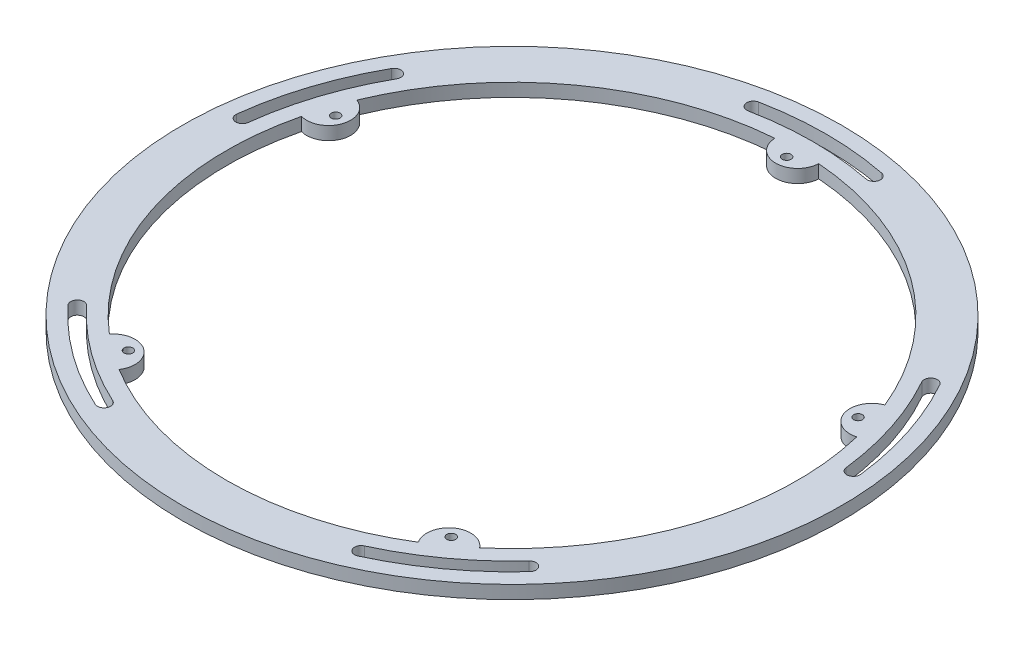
ISO-10303-21;
HEADER;
FILE_DESCRIPTION(('STEP AP214'),'2;1');
FILE_NAME('part.step','',(''),(''),'','','');
FILE_SCHEMA(('AUTOMOTIVE_DESIGN { 1 0 10303 214 1 1 1 1 }'));
ENDSEC;
DATA;
#1=APPLICATION_CONTEXT('core data for automotive mechanical design processes');
#2=APPLICATION_PROTOCOL_DEFINITION('international standard','automotive_design',2000,#1);
#3=PRODUCT_CONTEXT('',#1,'mechanical');
#4=PRODUCT('Part','Part','',(#3));
#5=PRODUCT_RELATED_PRODUCT_CATEGORY('part','',(#4));
#6=PRODUCT_DEFINITION_FORMATION('','',#4);
#7=PRODUCT_DEFINITION_CONTEXT('part definition',#1,'design');
#8=PRODUCT_DEFINITION('design','',#6,#7);
#9=PRODUCT_DEFINITION_SHAPE('','',#8);
#10=(LENGTH_UNIT() NAMED_UNIT(*) SI_UNIT(.MILLI.,.METRE.));
#11=(NAMED_UNIT(*) PLANE_ANGLE_UNIT() SI_UNIT($,.RADIAN.));
#12=(NAMED_UNIT(*) SI_UNIT($,.STERADIAN.) SOLID_ANGLE_UNIT());
#13=UNCERTAINTY_MEASURE_WITH_UNIT(LENGTH_MEASURE(1.E-05),#10,'distance_accuracy_value','');
#14=(GEOMETRIC_REPRESENTATION_CONTEXT(3) GLOBAL_UNCERTAINTY_ASSIGNED_CONTEXT((#13)) GLOBAL_UNIT_ASSIGNED_CONTEXT((#10,
#11,#12)) REPRESENTATION_CONTEXT('',''));
#15=CARTESIAN_POINT('',(0.,0.,0.));
#16=DIRECTION('',(0.,0.,1.));
#17=DIRECTION('',(1.,0.,0.));
#18=AXIS2_PLACEMENT_3D('',#15,#16,#17);
#19=CARTESIAN_POINT('',(-38.2060413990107,3.,52.5861046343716));
#20=DIRECTION('',(0.,-1.,0.));
#21=DIRECTION('',(0.,0.,-1.));
#22=AXIS2_PLACEMENT_3D('',#19,#20,#21);
#23=CYLINDRICAL_SURFACE('',#22,5.);
#24=CARTESIAN_POINT('',(-38.2060413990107,0.,52.5861046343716));
#25=DIRECTION('',(0.,1.,0.));
#26=DIRECTION('',(0.,0.,1.));
#27=AXIS2_PLACEMENT_3D('',#24,#25,#26);
#28=CIRCLE('',#27,5.);
#29=CARTESIAN_POINT('',(-42.1350977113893,0.,49.4937727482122));
#30=VERTEX_POINT('',#29);
#31=CARTESIAN_POINT('',(-34.0509138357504,0.,55.3672761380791));
#32=VERTEX_POINT('',#31);
#33=EDGE_CURVE('E345',#30,#32,#28,.F.);
#34=ORIENTED_EDGE('',*,*,#33,.F.);
#35=DIRECTION('',(0.,-1.,0.));
#36=VECTOR('',#35,1.);
#37=CARTESIAN_POINT('',(-42.1350977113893,3.,49.4937727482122));
#38=LINE('',#37,#36);
#39=CARTESIAN_POINT('',(-42.1350977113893,3.,49.4937727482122));
#40=VERTEX_POINT('',#39);
#41=EDGE_CURVE('E11',#40,#30,#38,.T.);
#42=ORIENTED_EDGE('',*,*,#41,.F.);
#43=CARTESIAN_POINT('',(-38.2060413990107,3.,52.5861046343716));
#44=DIRECTION('',(0.,1.,0.));
#45=DIRECTION('',(0.,0.,1.));
#46=AXIS2_PLACEMENT_3D('',#43,#44,#45);
#47=CIRCLE('',#46,5.);
#48=CARTESIAN_POINT('',(-34.0509138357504,3.,55.3672761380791));
#49=VERTEX_POINT('',#48);
#50=EDGE_CURVE('E508',#40,#49,#47,.F.);
#51=ORIENTED_EDGE('',*,*,#50,.T.);
#52=DIRECTION('',(0.,-1.,0.));
#53=VECTOR('',#52,1.);
#54=CARTESIAN_POINT('',(-34.0509138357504,3.,55.3672761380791));
#55=LINE('',#54,#53);
#56=EDGE_CURVE('E154',#49,#32,#55,.T.);
#57=ORIENTED_EDGE('',*,*,#56,.T.);
#58=EDGE_LOOP('',(#34,#42,#51,#57));
#59=FACE_BOUND('',#58,.T.);
#60=ADVANCED_FACE('F35',(#59),#23,.T.);
#61=CARTESIAN_POINT('',(1.59594559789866E-13,3.,2.22044604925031E-13));
#62=DIRECTION('',(0.,-1.,0.));
#63=DIRECTION('',(0.,0.,-1.));
#64=AXIS2_PLACEMENT_3D('',#61,#62,#63);
#65=CYLINDRICAL_SURFACE('',#64,65.0000000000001);
#66=CARTESIAN_POINT('',(1.59594559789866E-13,0.,2.22044604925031E-13));
#67=DIRECTION('',(0.,1.,0.));
#68=DIRECTION('',(0.,0.,1.));
#69=AXIS2_PLACEMENT_3D('',#66,#67,#68);
#70=CIRCLE('',#69,65.0000000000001);
#71=CARTESIAN_POINT('',(-63.179719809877,0.,-15.274914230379));
#72=VERTEX_POINT('',#71);
#73=EDGE_CURVE('E348',#30,#72,#70,.F.);
#74=ORIENTED_EDGE('',*,*,#73,.T.);
#75=DIRECTION('',(0.,-1.,0.));
#76=VECTOR('',#75,1.);
#77=CARTESIAN_POINT('',(-63.179719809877,3.,-15.274914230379));
#78=LINE('',#77,#76);
#79=CARTESIAN_POINT('',(-63.179719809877,3.,-15.274914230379));
#80=VERTEX_POINT('',#79);
#81=EDGE_CURVE('E45',#80,#72,#78,.T.);
#82=ORIENTED_EDGE('',*,*,#81,.F.);
#83=CARTESIAN_POINT('',(1.59594559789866E-13,3.,2.22044604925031E-13));
#84=DIRECTION('',(0.,1.,0.));
#85=DIRECTION('',(0.,0.,1.));
#86=AXIS2_PLACEMENT_3D('',#83,#84,#85);
#87=CIRCLE('',#86,65.0000000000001);
#88=EDGE_CURVE('E510',#40,#80,#87,.F.);
#89=ORIENTED_EDGE('',*,*,#88,.F.);
#90=ORIENTED_EDGE('',*,*,#41,.T.);
#91=EDGE_LOOP('',(#74,#82,#89,#90));
#92=FACE_BOUND('',#91,.T.);
#93=ADVANCED_FACE('F533',(#92),#65,.F.);
#94=CARTESIAN_POINT('',(-61.8186735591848,3.,-20.0861046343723));
#95=DIRECTION('',(0.,-1.,0.));
#96=DIRECTION('',(0.,0.,-1.));
#97=AXIS2_PLACEMENT_3D('',#94,#95,#96);
#98=CYLINDRICAL_SURFACE('',#97,5.);
#99=CARTESIAN_POINT('',(-61.8186735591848,0.,-20.0861046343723));
#100=DIRECTION('',(0.,1.,0.));
#101=DIRECTION('',(0.,0.,1.));
#102=AXIS2_PLACEMENT_3D('',#99,#100,#101);
#103=CIRCLE('',#102,5.);
#104=CARTESIAN_POINT('',(-60.0918363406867,0.,-24.7784423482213));
#105=VERTEX_POINT('',#104);
#106=EDGE_CURVE('E351',#105,#72,#103,.F.);
#107=ORIENTED_EDGE('',*,*,#106,.F.);
#108=DIRECTION('',(0.,-1.,0.));
#109=VECTOR('',#108,1.);
#110=CARTESIAN_POINT('',(-60.0918363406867,3.,-24.7784423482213));
#111=LINE('',#110,#109);
#112=CARTESIAN_POINT('',(-60.0918363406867,3.,-24.7784423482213));
#113=VERTEX_POINT('',#112);
#114=EDGE_CURVE('E382',#113,#105,#111,.T.);
#115=ORIENTED_EDGE('',*,*,#114,.F.);
#116=CARTESIAN_POINT('',(-61.8186735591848,3.,-20.0861046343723));
#117=DIRECTION('',(0.,1.,0.));
#118=DIRECTION('',(0.,0.,1.));
#119=AXIS2_PLACEMENT_3D('',#116,#117,#118);
#120=CIRCLE('',#119,5.);
#121=EDGE_CURVE('E512',#113,#80,#120,.F.);
#122=ORIENTED_EDGE('',*,*,#121,.T.);
#123=ORIENTED_EDGE('',*,*,#81,.T.);
#124=EDGE_LOOP('',(#107,#115,#122,#123));
#125=FACE_BOUND('',#124,.T.);
#126=ADVANCED_FACE('F536',(#125),#98,.T.);
#127=CARTESIAN_POINT('',(1.59594559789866E-13,3.,2.22044604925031E-13));
#128=DIRECTION('',(0.,-1.,0.));
#129=DIRECTION('',(0.,0.,-1.));
#130=AXIS2_PLACEMENT_3D('',#127,#128,#129);
#131=CYLINDRICAL_SURFACE('',#130,65.0000000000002);
#132=CARTESIAN_POINT('',(1.59594559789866E-13,0.,2.22044604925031E-13));
#133=DIRECTION('',(0.,1.,0.));
#134=DIRECTION('',(0.,0.,1.));
#135=AXIS2_PLACEMENT_3D('',#132,#133,#134);
#136=CIRCLE('',#135,65.0000000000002);
#137=CARTESIAN_POINT('',(-4.99630040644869,0.,-64.8076923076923));
#138=VERTEX_POINT('',#137);
#139=EDGE_CURVE('E354',#105,#138,#136,.F.);
#140=ORIENTED_EDGE('',*,*,#139,.T.);
#141=DIRECTION('',(0.,-1.,0.));
#142=VECTOR('',#141,1.);
#143=CARTESIAN_POINT('',(-4.99630040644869,3.,-64.8076923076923));
#144=LINE('',#143,#142);
#145=CARTESIAN_POINT('',(-4.99630040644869,3.,-64.8076923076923));
#146=VERTEX_POINT('',#145);
#147=EDGE_CURVE('E380',#146,#138,#144,.T.);
#148=ORIENTED_EDGE('',*,*,#147,.F.);
#149=CARTESIAN_POINT('',(1.59594559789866E-13,3.,2.22044604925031E-13));
#150=DIRECTION('',(0.,1.,0.));
#151=DIRECTION('',(0.,0.,1.));
#152=AXIS2_PLACEMENT_3D('',#149,#150,#151);
#153=CIRCLE('',#152,65.0000000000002);
#154=EDGE_CURVE('E515',#113,#146,#153,.F.);
#155=ORIENTED_EDGE('',*,*,#154,.F.);
#156=ORIENTED_EDGE('',*,*,#114,.T.);
#157=EDGE_LOOP('',(#140,#148,#155,#156));
#158=FACE_BOUND('',#157,.T.);
#159=ADVANCED_FACE('F541',(#158),#131,.F.);
#160=CARTESIAN_POINT('',(0.,3.,-65.));
#161=DIRECTION('',(0.,-1.,0.));
#162=DIRECTION('',(0.,0.,-1.));
#163=AXIS2_PLACEMENT_3D('',#160,#161,#162);
#164=CYLINDRICAL_SURFACE('',#163,5.);
#165=CARTESIAN_POINT('',(0.,0.,-65.));
#166=DIRECTION('',(0.,1.,0.));
#167=DIRECTION('',(0.,0.,1.));
#168=AXIS2_PLACEMENT_3D('',#165,#166,#167);
#169=CIRCLE('',#168,5.);
#170=CARTESIAN_POINT('',(4.99630040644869,0.,-64.8076923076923));
#171=VERTEX_POINT('',#170);
#172=EDGE_CURVE('E357',#171,#138,#169,.F.);
#173=ORIENTED_EDGE('',*,*,#172,.F.);
#174=DIRECTION('',(0.,-1.,0.));
#175=VECTOR('',#174,1.);
#176=CARTESIAN_POINT('',(4.99630040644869,3.,-64.8076923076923));
#177=LINE('',#176,#175);
#178=CARTESIAN_POINT('',(4.99630040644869,3.,-64.8076923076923));
#179=VERTEX_POINT('',#178);
#180=EDGE_CURVE('E378',#179,#171,#177,.T.);
#181=ORIENTED_EDGE('',*,*,#180,.F.);
#182=CARTESIAN_POINT('',(0.,3.,-65.));
#183=DIRECTION('',(0.,1.,0.));
#184=DIRECTION('',(0.,0.,1.));
#185=AXIS2_PLACEMENT_3D('',#182,#183,#184);
#186=CIRCLE('',#185,5.);
#187=EDGE_CURVE('E517',#179,#146,#186,.F.);
#188=ORIENTED_EDGE('',*,*,#187,.T.);
#189=ORIENTED_EDGE('',*,*,#147,.T.);
#190=EDGE_LOOP('',(#173,#181,#188,#189));
#191=FACE_BOUND('',#190,.T.);
#192=ADVANCED_FACE('F546',(#191),#164,.T.);
#193=CARTESIAN_POINT('',(1.59594559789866E-13,3.,2.22044604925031E-13));
#194=DIRECTION('',(0.,-1.,0.));
#195=DIRECTION('',(0.,0.,-1.));
#196=AXIS2_PLACEMENT_3D('',#193,#194,#195);
#197=CYLINDRICAL_SURFACE('',#196,65.0000000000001);
#198=CARTESIAN_POINT('',(1.59594559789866E-13,0.,2.22044604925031E-13));
#199=DIRECTION('',(0.,1.,0.));
#200=DIRECTION('',(0.,0.,1.));
#201=AXIS2_PLACEMENT_3D('',#198,#199,#200);
#202=CIRCLE('',#201,65.0000000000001);
#203=CARTESIAN_POINT('',(60.0918363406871,0.,-24.7784423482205));
#204=VERTEX_POINT('',#203);
#205=EDGE_CURVE('E360',#171,#204,#202,.F.);
#206=ORIENTED_EDGE('',*,*,#205,.T.);
#207=DIRECTION('',(0.,-1.,0.));
#208=VECTOR('',#207,1.);
#209=CARTESIAN_POINT('',(60.0918363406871,3.,-24.7784423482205));
#210=LINE('',#209,#208);
#211=CARTESIAN_POINT('',(60.0918363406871,3.,-24.7784423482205));
#212=VERTEX_POINT('',#211);
#213=EDGE_CURVE('E376',#212,#204,#210,.T.);
#214=ORIENTED_EDGE('',*,*,#213,.F.);
#215=CARTESIAN_POINT('',(1.59594559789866E-13,3.,2.22044604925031E-13));
#216=DIRECTION('',(0.,1.,0.));
#217=DIRECTION('',(0.,0.,1.));
#218=AXIS2_PLACEMENT_3D('',#215,#216,#217);
#219=CIRCLE('',#218,65.0000000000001);
#220=EDGE_CURVE('E520',#179,#212,#219,.F.);
#221=ORIENTED_EDGE('',*,*,#220,.F.);
#222=ORIENTED_EDGE('',*,*,#180,.T.);
#223=EDGE_LOOP('',(#206,#214,#221,#222));
#224=FACE_BOUND('',#223,.T.);
#225=ADVANCED_FACE('F548',(#224),#197,.F.);
#226=CARTESIAN_POINT('',(61.8186735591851,3.,-20.0861046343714));
#227=DIRECTION('',(0.,-1.,0.));
#228=DIRECTION('',(0.,0.,-1.));
#229=AXIS2_PLACEMENT_3D('',#226,#227,#228);
#230=CYLINDRICAL_SURFACE('',#229,5.);
#231=CARTESIAN_POINT('',(61.8186735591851,0.,-20.0861046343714));
#232=DIRECTION('',(0.,1.,0.));
#233=DIRECTION('',(0.,0.,1.));
#234=AXIS2_PLACEMENT_3D('',#231,#232,#233);
#235=CIRCLE('',#234,5.);
#236=CARTESIAN_POINT('',(63.1797198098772,0.,-15.2749142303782));
#237=VERTEX_POINT('',#236);
#238=EDGE_CURVE('E363',#237,#204,#235,.F.);
#239=ORIENTED_EDGE('',*,*,#238,.F.);
#240=DIRECTION('',(0.,-1.,0.));
#241=VECTOR('',#240,1.);
#242=CARTESIAN_POINT('',(63.1797198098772,3.,-15.2749142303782));
#243=LINE('',#242,#241);
#244=CARTESIAN_POINT('',(63.1797198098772,3.,-15.2749142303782));
#245=VERTEX_POINT('',#244);
#246=EDGE_CURVE('E259',#245,#237,#243,.T.);
#247=ORIENTED_EDGE('',*,*,#246,.F.);
#248=CARTESIAN_POINT('',(61.8186735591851,3.,-20.0861046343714));
#249=DIRECTION('',(0.,1.,0.));
#250=DIRECTION('',(0.,0.,1.));
#251=AXIS2_PLACEMENT_3D('',#248,#249,#250);
#252=CIRCLE('',#251,5.);
#253=EDGE_CURVE('E248',#245,#212,#252,.F.);
#254=ORIENTED_EDGE('',*,*,#253,.T.);
#255=ORIENTED_EDGE('',*,*,#213,.T.);
#256=EDGE_LOOP('',(#239,#247,#254,#255));
#257=FACE_BOUND('',#256,.T.);
#258=ADVANCED_FACE('F523',(#257),#230,.T.);
#259=CARTESIAN_POINT('',(1.59594559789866E-13,3.,2.22044604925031E-13));
#260=DIRECTION('',(0.,-1.,0.));
#261=DIRECTION('',(0.,0.,-1.));
#262=AXIS2_PLACEMENT_3D('',#259,#260,#261);
#263=CYLINDRICAL_SURFACE('',#262,64.9999999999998);
#264=CARTESIAN_POINT('',(1.59594559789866E-13,0.,2.22044604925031E-13));
#265=DIRECTION('',(0.,1.,0.));
#266=DIRECTION('',(0.,0.,1.));
#267=AXIS2_PLACEMENT_3D('',#264,#265,#266);
#268=CIRCLE('',#267,64.9999999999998);
#269=CARTESIAN_POINT('',(42.1350977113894,0.,49.4937727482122));
#270=VERTEX_POINT('',#269);
#271=EDGE_CURVE('E255',#237,#270,#268,.F.);
#272=ORIENTED_EDGE('',*,*,#271,.T.);
#273=DIRECTION('',(0.,-1.,0.));
#274=VECTOR('',#273,1.);
#275=CARTESIAN_POINT('',(42.1350977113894,3.,49.4937727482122));
#276=LINE('',#275,#274);
#277=CARTESIAN_POINT('',(42.1350977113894,3.,49.4937727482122));
#278=VERTEX_POINT('',#277);
#279=EDGE_CURVE('E252',#278,#270,#276,.T.);
#280=ORIENTED_EDGE('',*,*,#279,.F.);
#281=CARTESIAN_POINT('',(1.59594559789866E-13,3.,2.22044604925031E-13));
#282=DIRECTION('',(0.,1.,0.));
#283=DIRECTION('',(0.,0.,1.));
#284=AXIS2_PLACEMENT_3D('',#281,#282,#283);
#285=CIRCLE('',#284,64.9999999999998);
#286=EDGE_CURVE('E242',#245,#278,#285,.F.);
#287=ORIENTED_EDGE('',*,*,#286,.F.);
#288=ORIENTED_EDGE('',*,*,#246,.T.);
#289=EDGE_LOOP('',(#272,#280,#287,#288));
#290=FACE_BOUND('',#289,.T.);
#291=ADVANCED_FACE('F253',(#290),#263,.F.);
#292=CARTESIAN_POINT('',(38.2060413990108,3.,52.5861046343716));
#293=DIRECTION('',(0.,-1.,0.));
#294=DIRECTION('',(0.,0.,-1.));
#295=AXIS2_PLACEMENT_3D('',#292,#293,#294);
#296=CYLINDRICAL_SURFACE('',#295,5.);
#297=CARTESIAN_POINT('',(38.2060413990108,0.,52.5861046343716));
#298=DIRECTION('',(0.,1.,0.));
#299=DIRECTION('',(0.,0.,1.));
#300=AXIS2_PLACEMENT_3D('',#297,#298,#299);
#301=CIRCLE('',#300,5.);
#302=CARTESIAN_POINT('',(34.0509138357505,0.,55.367276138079));
#303=VERTEX_POINT('',#302);
#304=EDGE_CURVE('E367',#303,#270,#301,.F.);
#305=ORIENTED_EDGE('',*,*,#304,.F.);
#306=DIRECTION('',(0.,-1.,0.));
#307=VECTOR('',#306,1.);
#308=CARTESIAN_POINT('',(34.0509138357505,3.,55.367276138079));
#309=LINE('',#308,#307);
#310=CARTESIAN_POINT('',(34.0509138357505,3.,55.367276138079));
#311=VERTEX_POINT('',#310);
#312=EDGE_CURVE('E147',#311,#303,#309,.T.);
#313=ORIENTED_EDGE('',*,*,#312,.F.);
#314=CARTESIAN_POINT('',(38.2060413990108,3.,52.5861046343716));
#315=DIRECTION('',(0.,1.,0.));
#316=DIRECTION('',(0.,0.,1.));
#317=AXIS2_PLACEMENT_3D('',#314,#315,#316);
#318=CIRCLE('',#317,5.);
#319=EDGE_CURVE('E246',#311,#278,#318,.F.);
#320=ORIENTED_EDGE('',*,*,#319,.T.);
#321=ORIENTED_EDGE('',*,*,#279,.T.);
#322=EDGE_LOOP('',(#305,#313,#320,#321));
#323=FACE_BOUND('',#322,.T.);
#324=ADVANCED_FACE('F261',(#323),#296,.T.);
#325=CARTESIAN_POINT('',(-69.5207625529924,3.,-8.17701498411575));
#326=DIRECTION('',(0.,-1.,0.));
#327=DIRECTION('',(0.,0.,-1.));
#328=AXIS2_PLACEMENT_3D('',#325,#326,#327);
#329=CYLINDRICAL_SURFACE('',#328,1.5);
#330=CARTESIAN_POINT('',(-69.5207625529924,0.,-8.17701498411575));
#331=DIRECTION('',(0.,1.,0.));
#332=DIRECTION('',(0.,0.,1.));
#333=AXIS2_PLACEMENT_3D('',#330,#331,#332);
#334=CIRCLE('',#333,1.5);
#335=CARTESIAN_POINT('',(-71.0104931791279,0.,-8.35223673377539));
#336=VERTEX_POINT('',#335);
#337=CARTESIAN_POINT('',(-68.0310319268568,0.,-8.00179323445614));
#338=VERTEX_POINT('',#337);
#339=EDGE_CURVE('E318',#336,#338,#334,.T.);
#340=ORIENTED_EDGE('',*,*,#339,.F.);
#341=DIRECTION('',(0.,-1.,0.));
#342=VECTOR('',#341,1.);
#343=CARTESIAN_POINT('',(-71.0104931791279,3.,-8.35223673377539));
#344=LINE('',#343,#342);
#345=CARTESIAN_POINT('',(-71.0104931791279,3.,-8.35223673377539));
#346=VERTEX_POINT('',#345);
#347=EDGE_CURVE('E373',#346,#336,#344,.T.);
#348=ORIENTED_EDGE('',*,*,#347,.F.);
#349=CARTESIAN_POINT('',(-69.5207625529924,3.,-8.17701498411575));
#350=DIRECTION('',(0.,1.,0.));
#351=DIRECTION('',(0.,0.,1.));
#352=AXIS2_PLACEMENT_3D('',#349,#350,#351);
#353=CIRCLE('',#352,1.5);
#354=CARTESIAN_POINT('',(-68.0310319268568,3.,-8.00179323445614));
#355=VERTEX_POINT('',#354);
#356=EDGE_CURVE('E482',#346,#355,#353,.T.);
#357=ORIENTED_EDGE('',*,*,#356,.T.);
#358=DIRECTION('',(0.,-1.,0.));
#359=VECTOR('',#358,1.);
#360=CARTESIAN_POINT('',(-68.0310319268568,3.,-8.00179323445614));
#361=LINE('',#360,#359);
#362=EDGE_CURVE('E385',#355,#338,#361,.T.);
#363=ORIENTED_EDGE('',*,*,#362,.T.);
#364=EDGE_LOOP('',(#340,#348,#357,#363));
#365=FACE_BOUND('',#364,.T.);
#366=ADVANCED_FACE('F598',(#365),#329,.F.);
#367=CARTESIAN_POINT('',(0.,3.,0.));
#368=DIRECTION('',(0.,-1.,0.));
#369=DIRECTION('',(0.,0.,-1.));
#370=AXIS2_PLACEMENT_3D('',#367,#368,#369);
#371=CYLINDRICAL_SURFACE('',#370,71.5);
#372=CARTESIAN_POINT('',(0.,0.,0.));
#373=DIRECTION('',(0.,1.,0.));
#374=DIRECTION('',(0.,0.,1.));
#375=AXIS2_PLACEMENT_3D('',#372,#373,#374);
#376=CIRCLE('',#375,71.5);
#377=CARTESIAN_POINT('',(-62.3580173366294,0.,-34.9818191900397));
#378=VERTEX_POINT('',#377);
#379=EDGE_CURVE('E321',#378,#336,#376,.T.);
#380=ORIENTED_EDGE('',*,*,#379,.F.);
#381=DIRECTION('',(0.,-1.,0.));
#382=VECTOR('',#381,1.);
#383=CARTESIAN_POINT('',(-62.3580173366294,3.,-34.9818191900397));
#384=LINE('',#383,#382);
#385=CARTESIAN_POINT('',(-62.3580173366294,3.,-34.9818191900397));
#386=VERTEX_POINT('',#385);
#387=EDGE_CURVE('E390',#386,#378,#384,.T.);
#388=ORIENTED_EDGE('',*,*,#387,.F.);
#389=CARTESIAN_POINT('',(0.,3.,0.));
#390=DIRECTION('',(0.,1.,0.));
#391=DIRECTION('',(0.,0.,1.));
#392=AXIS2_PLACEMENT_3D('',#389,#390,#391);
#393=CIRCLE('',#392,71.5);
#394=EDGE_CURVE('E485',#386,#346,#393,.T.);
#395=ORIENTED_EDGE('',*,*,#394,.T.);
#396=ORIENTED_EDGE('',*,*,#347,.T.);
#397=EDGE_LOOP('',(#380,#388,#395,#396));
#398=FACE_BOUND('',#397,.T.);
#399=ADVANCED_FACE('F594',(#398),#371,.F.);
#400=CARTESIAN_POINT('',(-61.0498071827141,3.,-34.2479348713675));
#401=DIRECTION('',(0.,-1.,0.));
#402=DIRECTION('',(0.,0.,-1.));
#403=AXIS2_PLACEMENT_3D('',#400,#401,#402);
#404=CYLINDRICAL_SURFACE('',#403,1.50000000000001);
#405=CARTESIAN_POINT('',(-61.0498071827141,0.,-34.2479348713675));
#406=DIRECTION('',(0.,1.,0.));
#407=DIRECTION('',(0.,0.,1.));
#408=AXIS2_PLACEMENT_3D('',#405,#406,#407);
#409=CIRCLE('',#408,1.50000000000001);
#410=CARTESIAN_POINT('',(-59.7415970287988,0.,-33.5140505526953));
#411=VERTEX_POINT('',#410);
#412=EDGE_CURVE('E324',#411,#378,#409,.T.);
#413=ORIENTED_EDGE('',*,*,#412,.F.);
#414=DIRECTION('',(0.,-1.,0.));
#415=VECTOR('',#414,1.);
#416=CARTESIAN_POINT('',(-59.7415970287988,3.,-33.5140505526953));
#417=LINE('',#416,#415);
#418=CARTESIAN_POINT('',(-59.7415970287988,3.,-33.5140505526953));
#419=VERTEX_POINT('',#418);
#420=EDGE_CURVE('E387',#419,#411,#417,.T.);
#421=ORIENTED_EDGE('',*,*,#420,.F.);
#422=CARTESIAN_POINT('',(-61.0498071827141,3.,-34.2479348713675));
#423=DIRECTION('',(0.,1.,0.));
#424=DIRECTION('',(0.,0.,1.));
#425=AXIS2_PLACEMENT_3D('',#422,#423,#424);
#426=CIRCLE('',#425,1.50000000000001);
#427=EDGE_CURVE('E488',#419,#386,#426,.T.);
#428=ORIENTED_EDGE('',*,*,#427,.T.);
#429=ORIENTED_EDGE('',*,*,#387,.T.);
#430=EDGE_LOOP('',(#413,#421,#428,#429));
#431=FACE_BOUND('',#430,.T.);
#432=ADVANCED_FACE('F590',(#431),#404,.F.);
#433=CARTESIAN_POINT('',(-29.2599004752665,3.,63.5913376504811));
#434=DIRECTION('',(0.,-1.,0.));
#435=DIRECTION('',(0.,0.,-1.));
#436=AXIS2_PLACEMENT_3D('',#433,#434,#435);
#437=CYLINDRICAL_SURFACE('',#436,1.50000000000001);
#438=CARTESIAN_POINT('',(-29.2599004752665,0.,63.5913376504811));
#439=DIRECTION('',(0.,1.,0.));
#440=DIRECTION('',(0.,0.,1.));
#441=AXIS2_PLACEMENT_3D('',#438,#439,#440);
#442=CIRCLE('',#441,1.50000000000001);
#443=CARTESIAN_POINT('',(-29.8868983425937,0.,64.9540091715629));
#444=VERTEX_POINT('',#443);
#445=CARTESIAN_POINT('',(-28.6329026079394,0.,62.2286661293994));
#446=VERTEX_POINT('',#445);
#447=EDGE_CURVE('E306',#444,#446,#442,.T.);
#448=ORIENTED_EDGE('',*,*,#447,.F.);
#449=DIRECTION('',(0.,-1.,0.));
#450=VECTOR('',#449,1.);
#451=CARTESIAN_POINT('',(-29.8868983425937,3.,64.9540091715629));
#452=LINE('',#451,#450);
#453=CARTESIAN_POINT('',(-29.8868983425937,3.,64.9540091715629));
#454=VERTEX_POINT('',#453);
#455=EDGE_CURVE('E388',#454,#444,#452,.T.);
#456=ORIENTED_EDGE('',*,*,#455,.F.);
#457=CARTESIAN_POINT('',(-29.2599004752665,3.,63.5913376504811));
#458=DIRECTION('',(0.,1.,0.));
#459=DIRECTION('',(0.,0.,1.));
#460=AXIS2_PLACEMENT_3D('',#457,#458,#459);
#461=CIRCLE('',#460,1.50000000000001);
#462=CARTESIAN_POINT('',(-28.6329026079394,3.,62.2286661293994));
#463=VERTEX_POINT('',#462);
#464=EDGE_CURVE('E471',#454,#463,#461,.T.);
#465=ORIENTED_EDGE('',*,*,#464,.T.);
#466=DIRECTION('',(0.,-1.,0.));
#467=VECTOR('',#466,1.);
#468=CARTESIAN_POINT('',(-28.6329026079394,3.,62.2286661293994));
#469=LINE('',#468,#467);
#470=EDGE_CURVE('E393',#463,#446,#469,.T.);
#471=ORIENTED_EDGE('',*,*,#470,.T.);
#472=EDGE_LOOP('',(#448,#456,#465,#471));
#473=FACE_BOUND('',#472,.T.);
#474=ADVANCED_FACE('F593',(#473),#437,.F.);
#475=CARTESIAN_POINT('',(0.,3.,0.));
#476=DIRECTION('',(0.,-1.,0.));
#477=DIRECTION('',(0.,0.,-1.));
#478=AXIS2_PLACEMENT_3D('',#475,#476,#477);
#479=CYLINDRICAL_SURFACE('',#478,71.5);
#480=CARTESIAN_POINT('',(0.,0.,0.));
#481=DIRECTION('',(0.,1.,0.));
#482=DIRECTION('',(0.,0.,1.));
#483=AXIS2_PLACEMENT_3D('',#480,#481,#482);
#484=CIRCLE('',#483,71.5);
#485=CARTESIAN_POINT('',(-52.5393741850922,0.,48.4960221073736));
#486=VERTEX_POINT('',#485);
#487=EDGE_CURVE('E309',#486,#444,#484,.T.);
#488=ORIENTED_EDGE('',*,*,#487,.F.);
#489=DIRECTION('',(0.,-1.,0.));
#490=VECTOR('',#489,1.);
#491=CARTESIAN_POINT('',(-52.5393741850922,3.,48.4960221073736));
#492=LINE('',#491,#490);
#493=CARTESIAN_POINT('',(-52.5393741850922,3.,48.4960221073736));
#494=VERTEX_POINT('',#493);
#495=EDGE_CURVE('E398',#494,#486,#492,.T.);
#496=ORIENTED_EDGE('',*,*,#495,.F.);
#497=CARTESIAN_POINT('',(0.,3.,0.));
#498=DIRECTION('',(0.,1.,0.));
#499=DIRECTION('',(0.,0.,1.));
#500=AXIS2_PLACEMENT_3D('',#497,#498,#499);
#501=CIRCLE('',#500,71.5);
#502=EDGE_CURVE('E474',#494,#454,#501,.T.);
#503=ORIENTED_EDGE('',*,*,#502,.T.);
#504=ORIENTED_EDGE('',*,*,#455,.T.);
#505=EDGE_LOOP('',(#488,#496,#503,#504));
#506=FACE_BOUND('',#505,.T.);
#507=ADVANCED_FACE('F611',(#506),#479,.F.);
#508=CARTESIAN_POINT('',(-51.4371495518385,3.,47.478623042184));
#509=DIRECTION('',(0.,-1.,0.));
#510=DIRECTION('',(0.,0.,-1.));
#511=AXIS2_PLACEMENT_3D('',#508,#509,#510);
#512=CYLINDRICAL_SURFACE('',#511,1.50000000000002);
#513=CARTESIAN_POINT('',(-51.4371495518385,0.,47.478623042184));
#514=DIRECTION('',(0.,1.,0.));
#515=DIRECTION('',(0.,0.,1.));
#516=AXIS2_PLACEMENT_3D('',#513,#514,#515);
#517=CIRCLE('',#516,1.50000000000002);
#518=CARTESIAN_POINT('',(-50.3349249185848,0.,46.4612239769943));
#519=VERTEX_POINT('',#518);
#520=EDGE_CURVE('E312',#519,#486,#517,.T.);
#521=ORIENTED_EDGE('',*,*,#520,.F.);
#522=DIRECTION('',(0.,-1.,0.));
#523=VECTOR('',#522,1.);
#524=CARTESIAN_POINT('',(-50.3349249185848,3.,46.4612239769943));
#525=LINE('',#524,#523);
#526=CARTESIAN_POINT('',(-50.3349249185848,3.,46.4612239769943));
#527=VERTEX_POINT('',#526);
#528=EDGE_CURVE('E395',#527,#519,#525,.T.);
#529=ORIENTED_EDGE('',*,*,#528,.F.);
#530=CARTESIAN_POINT('',(-51.4371495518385,3.,47.478623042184));
#531=DIRECTION('',(0.,1.,0.));
#532=DIRECTION('',(0.,0.,1.));
#533=AXIS2_PLACEMENT_3D('',#530,#531,#532);
#534=CIRCLE('',#533,1.50000000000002);
#535=EDGE_CURVE('E477',#527,#494,#534,.T.);
#536=ORIENTED_EDGE('',*,*,#535,.T.);
#537=ORIENTED_EDGE('',*,*,#495,.T.);
#538=EDGE_LOOP('',(#521,#529,#536,#537));
#539=FACE_BOUND('',#538,.T.);
#540=ADVANCED_FACE('F607',(#539),#512,.F.);
#541=CARTESIAN_POINT('',(51.4371495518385,3.,47.478623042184));
#542=DIRECTION('',(0.,-1.,0.));
#543=DIRECTION('',(0.,0.,-1.));
#544=AXIS2_PLACEMENT_3D('',#541,#542,#543);
#545=CYLINDRICAL_SURFACE('',#544,1.5);
#546=CARTESIAN_POINT('',(51.4371495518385,0.,47.478623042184));
#547=DIRECTION('',(0.,1.,0.));
#548=DIRECTION('',(0.,0.,1.));
#549=AXIS2_PLACEMENT_3D('',#546,#547,#548);
#550=CIRCLE('',#549,1.5);
#551=CARTESIAN_POINT('',(52.5393741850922,0.,48.4960221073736));
#552=VERTEX_POINT('',#551);
#553=CARTESIAN_POINT('',(50.3349249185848,0.,46.4612239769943));
#554=VERTEX_POINT('',#553);
#555=EDGE_CURVE('E294',#552,#554,#550,.T.);
#556=ORIENTED_EDGE('',*,*,#555,.F.);
#557=DIRECTION('',(0.,-1.,0.));
#558=VECTOR('',#557,1.);
#559=CARTESIAN_POINT('',(52.5393741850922,3.,48.4960221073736));
#560=LINE('',#559,#558);
#561=CARTESIAN_POINT('',(52.5393741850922,3.,48.4960221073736));
#562=VERTEX_POINT('',#561);
#563=EDGE_CURVE('E396',#562,#552,#560,.T.);
#564=ORIENTED_EDGE('',*,*,#563,.F.);
#565=CARTESIAN_POINT('',(51.4371495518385,3.,47.478623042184));
#566=DIRECTION('',(0.,1.,0.));
#567=DIRECTION('',(0.,0.,1.));
#568=AXIS2_PLACEMENT_3D('',#565,#566,#567);
#569=CIRCLE('',#568,1.5);
#570=CARTESIAN_POINT('',(50.3349249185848,3.,46.4612239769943));
#571=VERTEX_POINT('',#570);
#572=EDGE_CURVE('E460',#562,#571,#569,.T.);
#573=ORIENTED_EDGE('',*,*,#572,.T.);
#574=DIRECTION('',(0.,-1.,0.));
#575=VECTOR('',#574,1.);
#576=CARTESIAN_POINT('',(50.3349249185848,3.,46.4612239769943));
#577=LINE('',#576,#575);
#578=EDGE_CURVE('E401',#571,#554,#577,.T.);
#579=ORIENTED_EDGE('',*,*,#578,.T.);
#580=EDGE_LOOP('',(#556,#564,#573,#579));
#581=FACE_BOUND('',#580,.T.);
#582=ADVANCED_FACE('F610',(#581),#545,.F.);
#583=CARTESIAN_POINT('',(0.,3.,0.));
#584=DIRECTION('',(0.,-1.,0.));
#585=DIRECTION('',(0.,0.,-1.));
#586=AXIS2_PLACEMENT_3D('',#583,#584,#585);
#587=CYLINDRICAL_SURFACE('',#586,71.5);
#588=CARTESIAN_POINT('',(0.,0.,0.));
#589=DIRECTION('',(0.,1.,0.));
#590=DIRECTION('',(0.,0.,1.));
#591=AXIS2_PLACEMENT_3D('',#588,#589,#590);
#592=CIRCLE('',#591,71.5);
#593=CARTESIAN_POINT('',(29.8868983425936,0.,64.9540091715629));
#594=VERTEX_POINT('',#593);
#595=EDGE_CURVE('E297',#594,#552,#592,.T.);
#596=ORIENTED_EDGE('',*,*,#595,.F.);
#597=DIRECTION('',(0.,-1.,0.));
#598=VECTOR('',#597,1.);
#599=CARTESIAN_POINT('',(29.8868983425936,3.,64.9540091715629));
#600=LINE('',#599,#598);
#601=CARTESIAN_POINT('',(29.8868983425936,3.,64.9540091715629));
#602=VERTEX_POINT('',#601);
#603=EDGE_CURVE('E406',#602,#594,#600,.T.);
#604=ORIENTED_EDGE('',*,*,#603,.F.);
#605=CARTESIAN_POINT('',(0.,3.,0.));
#606=DIRECTION('',(0.,1.,0.));
#607=DIRECTION('',(0.,0.,1.));
#608=AXIS2_PLACEMENT_3D('',#605,#606,#607);
#609=CIRCLE('',#608,71.5);
#610=EDGE_CURVE('E463',#602,#562,#609,.T.);
#611=ORIENTED_EDGE('',*,*,#610,.T.);
#612=ORIENTED_EDGE('',*,*,#563,.T.);
#613=EDGE_LOOP('',(#596,#604,#611,#612));
#614=FACE_BOUND('',#613,.T.);
#615=ADVANCED_FACE('F627',(#614),#587,.F.);
#616=CARTESIAN_POINT('',(29.2599004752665,3.,63.5913376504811));
#617=DIRECTION('',(0.,-1.,0.));
#618=DIRECTION('',(0.,0.,-1.));
#619=AXIS2_PLACEMENT_3D('',#616,#617,#618);
#620=CYLINDRICAL_SURFACE('',#619,1.5);
#621=CARTESIAN_POINT('',(29.2599004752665,0.,63.5913376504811));
#622=DIRECTION('',(0.,1.,0.));
#623=DIRECTION('',(0.,0.,1.));
#624=AXIS2_PLACEMENT_3D('',#621,#622,#623);
#625=CIRCLE('',#624,1.5);
#626=CARTESIAN_POINT('',(28.6329026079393,0.,62.2286661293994));
#627=VERTEX_POINT('',#626);
#628=EDGE_CURVE('E300',#627,#594,#625,.T.);
#629=ORIENTED_EDGE('',*,*,#628,.F.);
#630=DIRECTION('',(0.,-1.,0.));
#631=VECTOR('',#630,1.);
#632=CARTESIAN_POINT('',(28.6329026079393,3.,62.2286661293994));
#633=LINE('',#632,#631);
#634=CARTESIAN_POINT('',(28.6329026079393,3.,62.2286661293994));
#635=VERTEX_POINT('',#634);
#636=EDGE_CURVE('E403',#635,#627,#633,.T.);
#637=ORIENTED_EDGE('',*,*,#636,.F.);
#638=CARTESIAN_POINT('',(29.2599004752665,3.,63.5913376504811));
#639=DIRECTION('',(0.,1.,0.));
#640=DIRECTION('',(0.,0.,1.));
#641=AXIS2_PLACEMENT_3D('',#638,#639,#640);
#642=CIRCLE('',#641,1.5);
#643=EDGE_CURVE('E466',#635,#602,#642,.T.);
#644=ORIENTED_EDGE('',*,*,#643,.T.);
#645=ORIENTED_EDGE('',*,*,#603,.T.);
#646=EDGE_LOOP('',(#629,#637,#644,#645));
#647=FACE_BOUND('',#646,.T.);
#648=ADVANCED_FACE('F623',(#647),#620,.F.);
#649=CARTESIAN_POINT('',(61.0498071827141,3.,-34.2479348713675));
#650=DIRECTION('',(0.,-1.,0.));
#651=DIRECTION('',(0.,0.,-1.));
#652=AXIS2_PLACEMENT_3D('',#649,#650,#651);
#653=CYLINDRICAL_SURFACE('',#652,1.50000000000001);
#654=CARTESIAN_POINT('',(61.0498071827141,0.,-34.2479348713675));
#655=DIRECTION('',(0.,1.,0.));
#656=DIRECTION('',(0.,0.,1.));
#657=AXIS2_PLACEMENT_3D('',#654,#655,#656);
#658=CIRCLE('',#657,1.50000000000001);
#659=CARTESIAN_POINT('',(62.3580173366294,0.,-34.9818191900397));
#660=VERTEX_POINT('',#659);
#661=CARTESIAN_POINT('',(59.7415970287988,0.,-33.5140505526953));
#662=VERTEX_POINT('',#661);
#663=EDGE_CURVE('E282',#660,#662,#658,.T.);
#664=ORIENTED_EDGE('',*,*,#663,.F.);
#665=DIRECTION('',(0.,-1.,0.));
#666=VECTOR('',#665,1.);
#667=CARTESIAN_POINT('',(62.3580173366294,3.,-34.9818191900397));
#668=LINE('',#667,#666);
#669=CARTESIAN_POINT('',(62.3580173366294,3.,-34.9818191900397));
#670=VERTEX_POINT('',#669);
#671=EDGE_CURVE('E404',#670,#660,#668,.T.);
#672=ORIENTED_EDGE('',*,*,#671,.F.);
#673=CARTESIAN_POINT('',(61.0498071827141,3.,-34.2479348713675));
#674=DIRECTION('',(0.,1.,0.));
#675=DIRECTION('',(0.,0.,1.));
#676=AXIS2_PLACEMENT_3D('',#673,#674,#675);
#677=CIRCLE('',#676,1.50000000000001);
#678=CARTESIAN_POINT('',(59.7415970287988,3.,-33.5140505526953));
#679=VERTEX_POINT('',#678);
#680=EDGE_CURVE('E442',#670,#679,#677,.T.);
#681=ORIENTED_EDGE('',*,*,#680,.T.);
#682=DIRECTION('',(0.,-1.,0.));
#683=VECTOR('',#682,1.);
#684=CARTESIAN_POINT('',(59.7415970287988,3.,-33.5140505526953));
#685=LINE('',#684,#683);
#686=EDGE_CURVE('E409',#679,#662,#685,.T.);
#687=ORIENTED_EDGE('',*,*,#686,.T.);
#688=EDGE_LOOP('',(#664,#672,#681,#687));
#689=FACE_BOUND('',#688,.T.);
#690=ADVANCED_FACE('F626',(#689),#653,.F.);
#691=CARTESIAN_POINT('',(0.,3.,0.));
#692=DIRECTION('',(0.,-1.,0.));
#693=DIRECTION('',(0.,0.,-1.));
#694=AXIS2_PLACEMENT_3D('',#691,#692,#693);
#695=CYLINDRICAL_SURFACE('',#694,71.5);
#696=CARTESIAN_POINT('',(0.,0.,0.));
#697=DIRECTION('',(0.,1.,0.));
#698=DIRECTION('',(0.,0.,1.));
#699=AXIS2_PLACEMENT_3D('',#696,#697,#698);
#700=CIRCLE('',#699,71.5);
#701=CARTESIAN_POINT('',(71.0104931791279,0.,-8.35223673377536));
#702=VERTEX_POINT('',#701);
#703=EDGE_CURVE('E285',#702,#660,#700,.T.);
#704=ORIENTED_EDGE('',*,*,#703,.F.);
#705=DIRECTION('',(0.,-1.,0.));
#706=VECTOR('',#705,1.);
#707=CARTESIAN_POINT('',(71.0104931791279,3.,-8.35223673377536));
#708=LINE('',#707,#706);
#709=CARTESIAN_POINT('',(71.0104931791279,3.,-8.35223673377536));
#710=VERTEX_POINT('',#709);
#711=EDGE_CURVE('E413',#710,#702,#708,.T.);
#712=ORIENTED_EDGE('',*,*,#711,.F.);
#713=CARTESIAN_POINT('',(0.,3.,0.));
#714=DIRECTION('',(0.,1.,0.));
#715=DIRECTION('',(0.,0.,1.));
#716=AXIS2_PLACEMENT_3D('',#713,#714,#715);
#717=CIRCLE('',#716,71.5);
#718=EDGE_CURVE('E452',#710,#670,#717,.T.);
#719=ORIENTED_EDGE('',*,*,#718,.T.);
#720=ORIENTED_EDGE('',*,*,#671,.T.);
#721=EDGE_LOOP('',(#704,#712,#719,#720));
#722=FACE_BOUND('',#721,.T.);
#723=ADVANCED_FACE('F641',(#722),#695,.F.);
#724=CARTESIAN_POINT('',(69.5207625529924,3.,-8.17701498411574));
#725=DIRECTION('',(0.,-1.,0.));
#726=DIRECTION('',(0.,0.,-1.));
#727=AXIS2_PLACEMENT_3D('',#724,#725,#726);
#728=CYLINDRICAL_SURFACE('',#727,1.5);
#729=CARTESIAN_POINT('',(69.5207625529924,0.,-8.17701498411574));
#730=DIRECTION('',(0.,1.,0.));
#731=DIRECTION('',(0.,0.,1.));
#732=AXIS2_PLACEMENT_3D('',#729,#730,#731);
#733=CIRCLE('',#732,1.5);
#734=CARTESIAN_POINT('',(68.0310319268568,0.,-8.00179323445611));
#735=VERTEX_POINT('',#734);
#736=EDGE_CURVE('E288',#735,#702,#733,.T.);
#737=ORIENTED_EDGE('',*,*,#736,.F.);
#738=DIRECTION('',(0.,-1.,0.));
#739=VECTOR('',#738,1.);
#740=CARTESIAN_POINT('',(68.0310319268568,3.,-8.00179323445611));
#741=LINE('',#740,#739);
#742=CARTESIAN_POINT('',(68.0310319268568,3.,-8.00179323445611));
#743=VERTEX_POINT('',#742);
#744=EDGE_CURVE('E411',#743,#735,#741,.T.);
#745=ORIENTED_EDGE('',*,*,#744,.F.);
#746=CARTESIAN_POINT('',(69.5207625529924,3.,-8.17701498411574));
#747=DIRECTION('',(0.,1.,0.));
#748=DIRECTION('',(0.,0.,1.));
#749=AXIS2_PLACEMENT_3D('',#746,#747,#748);
#750=CIRCLE('',#749,1.5);
#751=EDGE_CURVE('E455',#743,#710,#750,.T.);
#752=ORIENTED_EDGE('',*,*,#751,.T.);
#753=ORIENTED_EDGE('',*,*,#711,.T.);
#754=EDGE_LOOP('',(#737,#745,#752,#753));
#755=FACE_BOUND('',#754,.T.);
#756=ADVANCED_FACE('F638',(#755),#728,.F.);
#757=CARTESIAN_POINT('',(-13.7062937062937,3.,-68.6450108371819));
#758=DIRECTION('',(0.,-1.,0.));
#759=DIRECTION('',(0.,0.,-1.));
#760=AXIS2_PLACEMENT_3D('',#757,#758,#759);
#761=CYLINDRICAL_SURFACE('',#760,1.5);
#762=CARTESIAN_POINT('',(-13.7062937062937,0.,-68.6450108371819));
#763=DIRECTION('',(0.,1.,0.));
#764=DIRECTION('',(0.,0.,1.));
#765=AXIS2_PLACEMENT_3D('',#762,#763,#764);
#766=CIRCLE('',#765,1.5);
#767=CARTESIAN_POINT('',(-14.,0.,-70.1159753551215));
#768=VERTEX_POINT('',#767);
#769=CARTESIAN_POINT('',(-13.4125874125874,0.,-67.1740463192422));
#770=VERTEX_POINT('',#769);
#771=EDGE_CURVE('E270',#768,#770,#766,.T.);
#772=ORIENTED_EDGE('',*,*,#771,.F.);
#773=DIRECTION('',(0.,-1.,0.));
#774=VECTOR('',#773,1.);
#775=CARTESIAN_POINT('',(-14.,3.,-70.1159753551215));
#776=LINE('',#775,#774);
#777=CARTESIAN_POINT('',(-14.,3.,-70.1159753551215));
#778=VERTEX_POINT('',#777);
#779=EDGE_CURVE('E39',#778,#768,#776,.T.);
#780=ORIENTED_EDGE('',*,*,#779,.F.);
#781=CARTESIAN_POINT('',(-13.7062937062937,3.,-68.6450108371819));
#782=DIRECTION('',(0.,1.,0.));
#783=DIRECTION('',(0.,0.,1.));
#784=AXIS2_PLACEMENT_3D('',#781,#782,#783);
#785=CIRCLE('',#784,1.5);
#786=CARTESIAN_POINT('',(-13.4125874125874,3.,-67.1740463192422));
#787=VERTEX_POINT('',#786);
#788=EDGE_CURVE('E446',#778,#787,#785,.T.);
#789=ORIENTED_EDGE('',*,*,#788,.T.);
#790=DIRECTION('',(0.,-1.,0.));
#791=VECTOR('',#790,1.);
#792=CARTESIAN_POINT('',(-13.4125874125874,3.,-67.1740463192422));
#793=LINE('',#792,#791);
#794=EDGE_CURVE('E263',#787,#770,#793,.T.);
#795=ORIENTED_EDGE('',*,*,#794,.T.);
#796=EDGE_LOOP('',(#772,#780,#789,#795));
#797=FACE_BOUND('',#796,.T.);
#798=ADVANCED_FACE('F428',(#797),#761,.F.);
#799=CARTESIAN_POINT('',(0.,3.,0.));
#800=DIRECTION('',(0.,-1.,0.));
#801=DIRECTION('',(0.,0.,-1.));
#802=AXIS2_PLACEMENT_3D('',#799,#800,#801);
#803=CYLINDRICAL_SURFACE('',#802,71.5);
#804=CARTESIAN_POINT('',(0.,0.,0.));
#805=DIRECTION('',(0.,1.,0.));
#806=DIRECTION('',(0.,0.,1.));
#807=AXIS2_PLACEMENT_3D('',#804,#805,#806);
#808=CIRCLE('',#807,71.5);
#809=CARTESIAN_POINT('',(14.,0.,-70.1159753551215));
#810=VERTEX_POINT('',#809);
#811=EDGE_CURVE('E273',#810,#768,#808,.T.);
#812=ORIENTED_EDGE('',*,*,#811,.F.);
#813=DIRECTION('',(0.,-1.,0.));
#814=VECTOR('',#813,1.);
#815=CARTESIAN_POINT('',(14.,3.,-70.1159753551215));
#816=LINE('',#815,#814);
#817=CARTESIAN_POINT('',(14.,3.,-70.1159753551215));
#818=VERTEX_POINT('',#817);
#819=EDGE_CURVE('E418',#818,#810,#816,.T.);
#820=ORIENTED_EDGE('',*,*,#819,.F.);
#821=CARTESIAN_POINT('',(0.,3.,0.));
#822=DIRECTION('',(0.,1.,0.));
#823=DIRECTION('',(0.,0.,1.));
#824=AXIS2_PLACEMENT_3D('',#821,#822,#823);
#825=CIRCLE('',#824,71.5);
#826=EDGE_CURVE('E427',#818,#778,#825,.T.);
#827=ORIENTED_EDGE('',*,*,#826,.T.);
#828=ORIENTED_EDGE('',*,*,#779,.T.);
#829=EDGE_LOOP('',(#812,#820,#827,#828));
#830=FACE_BOUND('',#829,.T.);
#831=ADVANCED_FACE('F425',(#830),#803,.F.);
#832=CARTESIAN_POINT('',(13.7062937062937,3.,-68.6450108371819));
#833=DIRECTION('',(0.,-1.,0.));
#834=DIRECTION('',(0.,0.,-1.));
#835=AXIS2_PLACEMENT_3D('',#832,#833,#834);
#836=CYLINDRICAL_SURFACE('',#835,1.5);
#837=CARTESIAN_POINT('',(13.7062937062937,0.,-68.6450108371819));
#838=DIRECTION('',(0.,1.,0.));
#839=DIRECTION('',(0.,0.,1.));
#840=AXIS2_PLACEMENT_3D('',#837,#838,#839);
#841=CIRCLE('',#840,1.5);
#842=CARTESIAN_POINT('',(13.4125874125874,0.,-67.1740463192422));
#843=VERTEX_POINT('',#842);
#844=EDGE_CURVE('E276',#843,#810,#841,.T.);
#845=ORIENTED_EDGE('',*,*,#844,.F.);
#846=DIRECTION('',(0.,-1.,0.));
#847=VECTOR('',#846,1.);
#848=CARTESIAN_POINT('',(13.4125874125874,3.,-67.1740463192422));
#849=LINE('',#848,#847);
#850=CARTESIAN_POINT('',(13.4125874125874,3.,-67.1740463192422));
#851=VERTEX_POINT('',#850);
#852=EDGE_CURVE('E417',#851,#843,#849,.T.);
#853=ORIENTED_EDGE('',*,*,#852,.F.);
#854=CARTESIAN_POINT('',(13.7062937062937,3.,-68.6450108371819));
#855=DIRECTION('',(0.,1.,0.));
#856=DIRECTION('',(0.,0.,1.));
#857=AXIS2_PLACEMENT_3D('',#854,#855,#856);
#858=CIRCLE('',#857,1.5);
#859=EDGE_CURVE('E437',#851,#818,#858,.T.);
#860=ORIENTED_EDGE('',*,*,#859,.T.);
#861=ORIENTED_EDGE('',*,*,#819,.T.);
#862=EDGE_LOOP('',(#845,#853,#860,#861));
#863=FACE_BOUND('',#862,.T.);
#864=ADVANCED_FACE('F434',(#863),#836,.F.);
#865=CARTESIAN_POINT('',(-59.4410322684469,3.,-19.3135621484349));
#866=DIRECTION('',(0.,-1.,0.));
#867=DIRECTION('',(0.,0.,-1.));
#868=AXIS2_PLACEMENT_3D('',#865,#866,#867);
#869=CYLINDRICAL_SURFACE('',#868,0.999999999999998);
#870=CARTESIAN_POINT('',(-59.4410322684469,3.,-19.3135621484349));
#871=DIRECTION('',(0.,1.,0.));
#872=DIRECTION('',(0.,0.,1.));
#873=AXIS2_PLACEMENT_3D('',#870,#871,#872);
#874=CIRCLE('',#873,0.999999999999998);
#875=CARTESIAN_POINT('',(-59.4410322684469,3.,-18.3135621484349));
#876=VERTEX_POINT('',#875);
#877=EDGE_CURVE('E505',#876,#876,#874,.T.);
#878=ORIENTED_EDGE('',*,*,#877,.T.);
#879=EDGE_LOOP('',(#878));
#880=FACE_BOUND('',#879,.T.);
#881=CARTESIAN_POINT('',(-59.4410322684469,0.,-19.3135621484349));
#882=DIRECTION('',(0.,1.,0.));
#883=DIRECTION('',(0.,0.,1.));
#884=AXIS2_PLACEMENT_3D('',#881,#882,#883);
#885=CIRCLE('',#884,0.999999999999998);
#886=CARTESIAN_POINT('',(-59.4410322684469,0.,-18.3135621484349));
#887=VERTEX_POINT('',#886);
#888=EDGE_CURVE('E342',#887,#887,#885,.T.);
#889=ORIENTED_EDGE('',*,*,#888,.F.);
#890=EDGE_LOOP('',(#889));
#891=FACE_BOUND('',#890,.T.);
#892=ADVANCED_FACE('F565',(#880,#891),#869,.F.);
#893=CARTESIAN_POINT('',(-36.7365782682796,3.,50.5635621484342));
#894=DIRECTION('',(0.,-1.,0.));
#895=DIRECTION('',(0.,0.,-1.));
#896=AXIS2_PLACEMENT_3D('',#893,#894,#895);
#897=CYLINDRICAL_SURFACE('',#896,1.00000000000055);
#898=CARTESIAN_POINT('',(-36.7365782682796,3.,50.5635621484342));
#899=DIRECTION('',(0.,1.,0.));
#900=DIRECTION('',(0.,0.,1.));
#901=AXIS2_PLACEMENT_3D('',#898,#899,#900);
#902=CIRCLE('',#901,1.00000000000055);
#903=CARTESIAN_POINT('',(-36.7365782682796,3.,51.5635621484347));
#904=VERTEX_POINT('',#903);
#905=EDGE_CURVE('E502',#904,#904,#902,.T.);
#906=ORIENTED_EDGE('',*,*,#905,.T.);
#907=EDGE_LOOP('',(#906));
#908=FACE_BOUND('',#907,.T.);
#909=CARTESIAN_POINT('',(-36.7365782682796,0.,50.5635621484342));
#910=DIRECTION('',(0.,1.,0.));
#911=DIRECTION('',(0.,0.,1.));
#912=AXIS2_PLACEMENT_3D('',#909,#910,#911);
#913=CIRCLE('',#912,1.00000000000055);
#914=CARTESIAN_POINT('',(-36.7365782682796,0.,51.5635621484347));
#915=VERTEX_POINT('',#914);
#916=EDGE_CURVE('E339',#915,#915,#913,.T.);
#917=ORIENTED_EDGE('',*,*,#916,.F.);
#918=EDGE_LOOP('',(#917));
#919=FACE_BOUND('',#918,.T.);
#920=ADVANCED_FACE('F568',(#908,#919),#897,.F.);
#921=CARTESIAN_POINT('',(36.7365782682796,3.,50.5635621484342));
#922=DIRECTION('',(0.,-1.,0.));
#923=DIRECTION('',(0.,0.,-1.));
#924=AXIS2_PLACEMENT_3D('',#921,#922,#923);
#925=CYLINDRICAL_SURFACE('',#924,1.00000000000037);
#926=CARTESIAN_POINT('',(36.7365782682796,3.,50.5635621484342));
#927=DIRECTION('',(0.,1.,0.));
#928=DIRECTION('',(0.,0.,1.));
#929=AXIS2_PLACEMENT_3D('',#926,#927,#928);
#930=CIRCLE('',#929,1.00000000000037);
#931=CARTESIAN_POINT('',(36.7365782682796,3.,51.5635621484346));
#932=VERTEX_POINT('',#931);
#933=EDGE_CURVE('E499',#932,#932,#930,.T.);
#934=ORIENTED_EDGE('',*,*,#933,.T.);
#935=EDGE_LOOP('',(#934));
#936=FACE_BOUND('',#935,.T.);
#937=CARTESIAN_POINT('',(36.7365782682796,0.,50.5635621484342));
#938=DIRECTION('',(0.,1.,0.));
#939=DIRECTION('',(0.,0.,1.));
#940=AXIS2_PLACEMENT_3D('',#937,#938,#939);
#941=CIRCLE('',#940,1.00000000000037);
#942=CARTESIAN_POINT('',(36.7365782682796,0.,51.5635621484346));
#943=VERTEX_POINT('',#942);
#944=EDGE_CURVE('E336',#943,#943,#941,.T.);
#945=ORIENTED_EDGE('',*,*,#944,.F.);
#946=EDGE_LOOP('',(#945));
#947=FACE_BOUND('',#946,.T.);
#948=ADVANCED_FACE('F572',(#936,#947),#925,.F.);
#949=CARTESIAN_POINT('',(59.4410322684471,3.,-19.3135621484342));
#950=DIRECTION('',(0.,-1.,0.));
#951=DIRECTION('',(0.,0.,-1.));
#952=AXIS2_PLACEMENT_3D('',#949,#950,#951);
#953=CYLINDRICAL_SURFACE('',#952,1.00000000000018);
#954=CARTESIAN_POINT('',(59.4410322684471,3.,-19.3135621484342));
#955=DIRECTION('',(0.,1.,0.));
#956=DIRECTION('',(0.,0.,1.));
#957=AXIS2_PLACEMENT_3D('',#954,#955,#956);
#958=CIRCLE('',#957,1.00000000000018);
#959=CARTESIAN_POINT('',(59.4410322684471,3.,-18.313562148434));
#960=VERTEX_POINT('',#959);
#961=EDGE_CURVE('E496',#960,#960,#958,.T.);
#962=ORIENTED_EDGE('',*,*,#961,.T.);
#963=EDGE_LOOP('',(#962));
#964=FACE_BOUND('',#963,.T.);
#965=CARTESIAN_POINT('',(59.4410322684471,0.,-19.3135621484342));
#966=DIRECTION('',(0.,1.,0.));
#967=DIRECTION('',(0.,0.,1.));
#968=AXIS2_PLACEMENT_3D('',#965,#966,#967);
#969=CIRCLE('',#968,1.00000000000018);
#970=CARTESIAN_POINT('',(59.4410322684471,0.,-18.313562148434));
#971=VERTEX_POINT('',#970);
#972=EDGE_CURVE('E333',#971,#971,#969,.T.);
#973=ORIENTED_EDGE('',*,*,#972,.F.);
#974=EDGE_LOOP('',(#973));
#975=FACE_BOUND('',#974,.T.);
#976=ADVANCED_FACE('F576',(#964,#975),#953,.F.);
#977=CARTESIAN_POINT('',(0.,3.,-62.5));
#978=DIRECTION('',(0.,-1.,0.));
#979=DIRECTION('',(0.,0.,-1.));
#980=AXIS2_PLACEMENT_3D('',#977,#978,#979);
#981=CYLINDRICAL_SURFACE('',#980,1.);
#982=CARTESIAN_POINT('',(0.,3.,-62.5));
#983=DIRECTION('',(0.,1.,0.));
#984=DIRECTION('',(0.,0.,1.));
#985=AXIS2_PLACEMENT_3D('',#982,#983,#984);
#986=CIRCLE('',#985,1.);
#987=CARTESIAN_POINT('',(0.,3.,-61.5));
#988=VERTEX_POINT('',#987);
#989=EDGE_CURVE('E493',#988,#988,#986,.T.);
#990=ORIENTED_EDGE('',*,*,#989,.T.);
#991=EDGE_LOOP('',(#990));
#992=FACE_BOUND('',#991,.T.);
#993=CARTESIAN_POINT('',(0.,0.,-62.5));
#994=DIRECTION('',(0.,1.,0.));
#995=DIRECTION('',(0.,0.,1.));
#996=AXIS2_PLACEMENT_3D('',#993,#994,#995);
#997=CIRCLE('',#996,1.);
#998=CARTESIAN_POINT('',(0.,0.,-61.5));
#999=VERTEX_POINT('',#998);
#1000=EDGE_CURVE('E330',#999,#999,#997,.T.);
#1001=ORIENTED_EDGE('',*,*,#1000,.F.);
#1002=EDGE_LOOP('',(#1001));
#1003=FACE_BOUND('',#1002,.T.);
#1004=ADVANCED_FACE('F580',(#992,#1003),#981,.F.);
#1005=CARTESIAN_POINT('',(0.,3.,0.));
#1006=DIRECTION('',(0.,-1.,0.));
#1007=DIRECTION('',(0.,0.,-1.));
#1008=AXIS2_PLACEMENT_3D('',#1005,#1006,#1007);
#1009=CYLINDRICAL_SURFACE('',#1008,68.5);
#1010=CARTESIAN_POINT('',(0.,0.,0.));
#1011=DIRECTION('',(0.,1.,0.));
#1012=DIRECTION('',(0.,0.,1.));
#1013=AXIS2_PLACEMENT_3D('',#1010,#1011,#1012);
#1014=CIRCLE('',#1013,68.5);
#1015=EDGE_CURVE('E327',#411,#338,#1014,.T.);
#1016=ORIENTED_EDGE('',*,*,#1015,.T.);
#1017=ORIENTED_EDGE('',*,*,#362,.F.);
#1018=CARTESIAN_POINT('',(0.,3.,0.));
#1019=DIRECTION('',(0.,1.,0.));
#1020=DIRECTION('',(0.,0.,1.));
#1021=AXIS2_PLACEMENT_3D('',#1018,#1019,#1020);
#1022=CIRCLE('',#1021,68.5);
#1023=EDGE_CURVE('E491',#419,#355,#1022,.T.);
#1024=ORIENTED_EDGE('',*,*,#1023,.F.);
#1025=ORIENTED_EDGE('',*,*,#420,.T.);
#1026=EDGE_LOOP('',(#1016,#1017,#1024,#1025));
#1027=FACE_BOUND('',#1026,.T.);
#1028=ADVANCED_FACE('F584',(#1027),#1009,.T.);
#1029=CARTESIAN_POINT('',(0.,3.,0.));
#1030=DIRECTION('',(0.,-1.,0.));
#1031=DIRECTION('',(0.,0.,-1.));
#1032=AXIS2_PLACEMENT_3D('',#1029,#1030,#1031);
#1033=CYLINDRICAL_SURFACE('',#1032,68.5);
#1034=CARTESIAN_POINT('',(0.,0.,0.));
#1035=DIRECTION('',(0.,1.,0.));
#1036=DIRECTION('',(0.,0.,1.));
#1037=AXIS2_PLACEMENT_3D('',#1034,#1035,#1036);
#1038=CIRCLE('',#1037,68.5);
#1039=EDGE_CURVE('E315',#519,#446,#1038,.T.);
#1040=ORIENTED_EDGE('',*,*,#1039,.T.);
#1041=ORIENTED_EDGE('',*,*,#470,.F.);
#1042=CARTESIAN_POINT('',(0.,3.,0.));
#1043=DIRECTION('',(0.,1.,0.));
#1044=DIRECTION('',(0.,0.,1.));
#1045=AXIS2_PLACEMENT_3D('',#1042,#1043,#1044);
#1046=CIRCLE('',#1045,68.5);
#1047=EDGE_CURVE('E480',#527,#463,#1046,.T.);
#1048=ORIENTED_EDGE('',*,*,#1047,.F.);
#1049=ORIENTED_EDGE('',*,*,#528,.T.);
#1050=EDGE_LOOP('',(#1040,#1041,#1048,#1049));
#1051=FACE_BOUND('',#1050,.T.);
#1052=ADVANCED_FACE('F588',(#1051),#1033,.T.);
#1053=CARTESIAN_POINT('',(0.,3.,0.));
#1054=DIRECTION('',(0.,-1.,0.));
#1055=DIRECTION('',(0.,0.,-1.));
#1056=AXIS2_PLACEMENT_3D('',#1053,#1054,#1055);
#1057=CYLINDRICAL_SURFACE('',#1056,68.5);
#1058=CARTESIAN_POINT('',(0.,0.,0.));
#1059=DIRECTION('',(0.,1.,0.));
#1060=DIRECTION('',(0.,0.,1.));
#1061=AXIS2_PLACEMENT_3D('',#1058,#1059,#1060);
#1062=CIRCLE('',#1061,68.5);
#1063=EDGE_CURVE('E303',#627,#554,#1062,.T.);
#1064=ORIENTED_EDGE('',*,*,#1063,.T.);
#1065=ORIENTED_EDGE('',*,*,#578,.F.);
#1066=CARTESIAN_POINT('',(0.,3.,0.));
#1067=DIRECTION('',(0.,1.,0.));
#1068=DIRECTION('',(0.,0.,1.));
#1069=AXIS2_PLACEMENT_3D('',#1066,#1067,#1068);
#1070=CIRCLE('',#1069,68.5);
#1071=EDGE_CURVE('E469',#635,#571,#1070,.T.);
#1072=ORIENTED_EDGE('',*,*,#1071,.F.);
#1073=ORIENTED_EDGE('',*,*,#636,.T.);
#1074=EDGE_LOOP('',(#1064,#1065,#1072,#1073));
#1075=FACE_BOUND('',#1074,.T.);
#1076=ADVANCED_FACE('F605',(#1075),#1057,.T.);
#1077=CARTESIAN_POINT('',(0.,3.,0.));
#1078=DIRECTION('',(0.,-1.,0.));
#1079=DIRECTION('',(0.,0.,-1.));
#1080=AXIS2_PLACEMENT_3D('',#1077,#1078,#1079);
#1081=CYLINDRICAL_SURFACE('',#1080,68.5);
#1082=CARTESIAN_POINT('',(0.,0.,0.));
#1083=DIRECTION('',(0.,1.,0.));
#1084=DIRECTION('',(0.,0.,1.));
#1085=AXIS2_PLACEMENT_3D('',#1082,#1083,#1084);
#1086=CIRCLE('',#1085,68.5);
#1087=EDGE_CURVE('E291',#735,#662,#1086,.T.);
#1088=ORIENTED_EDGE('',*,*,#1087,.T.);
#1089=ORIENTED_EDGE('',*,*,#686,.F.);
#1090=CARTESIAN_POINT('',(0.,3.,0.));
#1091=DIRECTION('',(0.,1.,0.));
#1092=DIRECTION('',(0.,0.,1.));
#1093=AXIS2_PLACEMENT_3D('',#1090,#1091,#1092);
#1094=CIRCLE('',#1093,68.5);
#1095=EDGE_CURVE('E458',#743,#679,#1094,.T.);
#1096=ORIENTED_EDGE('',*,*,#1095,.F.);
#1097=ORIENTED_EDGE('',*,*,#744,.T.);
#1098=EDGE_LOOP('',(#1088,#1089,#1096,#1097));
#1099=FACE_BOUND('',#1098,.T.);
#1100=ADVANCED_FACE('F621',(#1099),#1081,.T.);
#1101=CARTESIAN_POINT('',(0.,3.,0.));
#1102=DIRECTION('',(0.,-1.,0.));
#1103=DIRECTION('',(0.,0.,-1.));
#1104=AXIS2_PLACEMENT_3D('',#1101,#1102,#1103);
#1105=CYLINDRICAL_SURFACE('',#1104,68.5);
#1106=CARTESIAN_POINT('',(0.,0.,0.));
#1107=DIRECTION('',(0.,1.,0.));
#1108=DIRECTION('',(0.,0.,1.));
#1109=AXIS2_PLACEMENT_3D('',#1106,#1107,#1108);
#1110=CIRCLE('',#1109,68.5);
#1111=EDGE_CURVE('E279',#843,#770,#1110,.T.);
#1112=ORIENTED_EDGE('',*,*,#1111,.T.);
#1113=ORIENTED_EDGE('',*,*,#794,.F.);
#1114=CARTESIAN_POINT('',(0.,3.,0.));
#1115=DIRECTION('',(0.,1.,0.));
#1116=DIRECTION('',(0.,0.,1.));
#1117=AXIS2_PLACEMENT_3D('',#1114,#1115,#1116);
#1118=CIRCLE('',#1117,68.5);
#1119=EDGE_CURVE('E439',#851,#787,#1118,.T.);
#1120=ORIENTED_EDGE('',*,*,#1119,.F.);
#1121=ORIENTED_EDGE('',*,*,#852,.T.);
#1122=EDGE_LOOP('',(#1112,#1113,#1120,#1121));
#1123=FACE_BOUND('',#1122,.T.);
#1124=ADVANCED_FACE('F440',(#1123),#1105,.T.);
#1125=CARTESIAN_POINT('',(0.,3.,0.));
#1126=DIRECTION('',(0.,-1.,0.));
#1127=DIRECTION('',(0.,0.,-1.));
#1128=AXIS2_PLACEMENT_3D('',#1125,#1126,#1127);
#1129=CYLINDRICAL_SURFACE('',#1128,75.);
#1130=CARTESIAN_POINT('',(0.,3.,0.));
#1131=DIRECTION('',(0.,1.,0.));
#1132=DIRECTION('',(0.,0.,1.));
#1133=AXIS2_PLACEMENT_3D('',#1130,#1131,#1132);
#1134=CIRCLE('',#1133,75.);
#1135=CARTESIAN_POINT('',(0.,3.,75.));
#1136=VERTEX_POINT('',#1135);
#1137=EDGE_CURVE('E371',#1136,#1136,#1134,.T.);
#1138=ORIENTED_EDGE('',*,*,#1137,.F.);
#1139=EDGE_LOOP('',(#1138));
#1140=FACE_BOUND('',#1139,.T.);
#1141=CARTESIAN_POINT('',(0.,0.,0.));
#1142=DIRECTION('',(0.,1.,0.));
#1143=DIRECTION('',(0.,0.,1.));
#1144=AXIS2_PLACEMENT_3D('',#1141,#1142,#1143);
#1145=CIRCLE('',#1144,75.);
#1146=CARTESIAN_POINT('',(0.,0.,75.));
#1147=VERTEX_POINT('',#1146);
#1148=EDGE_CURVE('E267',#1147,#1147,#1145,.T.);
#1149=ORIENTED_EDGE('',*,*,#1148,.T.);
#1150=EDGE_LOOP('',(#1149));
#1151=FACE_BOUND('',#1150,.T.);
#1152=ADVANCED_FACE('F37',(#1140,#1151),#1129,.T.);
#1153=CARTESIAN_POINT('',(1.59594559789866E-13,3.,2.22044604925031E-13));
#1154=DIRECTION('',(0.,-1.,0.));
#1155=DIRECTION('',(0.,0.,-1.));
#1156=AXIS2_PLACEMENT_3D('',#1153,#1154,#1155);
#1157=CYLINDRICAL_SURFACE('',#1156,64.9999999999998);
#1158=CARTESIAN_POINT('',(1.59594559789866E-13,0.,2.22044604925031E-13));
#1159=DIRECTION('',(0.,1.,0.));
#1160=DIRECTION('',(0.,0.,1.));
#1161=AXIS2_PLACEMENT_3D('',#1158,#1159,#1160);
#1162=CIRCLE('',#1161,64.9999999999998);
#1163=EDGE_CURVE('E369',#303,#32,#1162,.F.);
#1164=ORIENTED_EDGE('',*,*,#1163,.T.);
#1165=ORIENTED_EDGE('',*,*,#56,.F.);
#1166=CARTESIAN_POINT('',(1.59594559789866E-13,3.,2.22044604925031E-13));
#1167=DIRECTION('',(0.,1.,0.));
#1168=DIRECTION('',(0.,0.,1.));
#1169=AXIS2_PLACEMENT_3D('',#1166,#1167,#1168);
#1170=CIRCLE('',#1169,64.9999999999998);
#1171=EDGE_CURVE('E54',#311,#49,#1170,.F.);
#1172=ORIENTED_EDGE('',*,*,#1171,.F.);
#1173=ORIENTED_EDGE('',*,*,#312,.T.);
#1174=EDGE_LOOP('',(#1164,#1165,#1172,#1173));
#1175=FACE_BOUND('',#1174,.T.);
#1176=ADVANCED_FACE('F528',(#1175),#1157,.F.);
#1177=CARTESIAN_POINT('',(0.,3.,0.));
#1178=DIRECTION('',(0.,1.,0.));
#1179=DIRECTION('',(0.,0.,1.));
#1180=AXIS2_PLACEMENT_3D('',#1177,#1178,#1179);
#1181=PLANE('',#1180);
#1182=ORIENTED_EDGE('',*,*,#1137,.T.);
#1183=EDGE_LOOP('',(#1182));
#1184=FACE_BOUND('',#1183,.T.);
#1185=ORIENTED_EDGE('',*,*,#788,.F.);
#1186=ORIENTED_EDGE('',*,*,#826,.F.);
#1187=ORIENTED_EDGE('',*,*,#859,.F.);
#1188=ORIENTED_EDGE('',*,*,#1119,.T.);
#1189=EDGE_LOOP('',(#1185,#1186,#1187,#1188));
#1190=FACE_BOUND('',#1189,.T.);
#1191=ORIENTED_EDGE('',*,*,#680,.F.);
#1192=ORIENTED_EDGE('',*,*,#718,.F.);
#1193=ORIENTED_EDGE('',*,*,#751,.F.);
#1194=ORIENTED_EDGE('',*,*,#1095,.T.);
#1195=EDGE_LOOP('',(#1191,#1192,#1193,#1194));
#1196=FACE_BOUND('',#1195,.T.);
#1197=ORIENTED_EDGE('',*,*,#572,.F.);
#1198=ORIENTED_EDGE('',*,*,#610,.F.);
#1199=ORIENTED_EDGE('',*,*,#643,.F.);
#1200=ORIENTED_EDGE('',*,*,#1071,.T.);
#1201=EDGE_LOOP('',(#1197,#1198,#1199,#1200));
#1202=FACE_BOUND('',#1201,.T.);
#1203=ORIENTED_EDGE('',*,*,#464,.F.);
#1204=ORIENTED_EDGE('',*,*,#502,.F.);
#1205=ORIENTED_EDGE('',*,*,#535,.F.);
#1206=ORIENTED_EDGE('',*,*,#1047,.T.);
#1207=EDGE_LOOP('',(#1203,#1204,#1205,#1206));
#1208=FACE_BOUND('',#1207,.T.);
#1209=ORIENTED_EDGE('',*,*,#356,.F.);
#1210=ORIENTED_EDGE('',*,*,#394,.F.);
#1211=ORIENTED_EDGE('',*,*,#427,.F.);
#1212=ORIENTED_EDGE('',*,*,#1023,.T.);
#1213=EDGE_LOOP('',(#1209,#1210,#1211,#1212));
#1214=FACE_BOUND('',#1213,.T.);
#1215=ORIENTED_EDGE('',*,*,#989,.F.);
#1216=EDGE_LOOP('',(#1215));
#1217=FACE_BOUND('',#1216,.T.);
#1218=ORIENTED_EDGE('',*,*,#961,.F.);
#1219=EDGE_LOOP('',(#1218));
#1220=FACE_BOUND('',#1219,.T.);
#1221=ORIENTED_EDGE('',*,*,#933,.F.);
#1222=EDGE_LOOP('',(#1221));
#1223=FACE_BOUND('',#1222,.T.);
#1224=ORIENTED_EDGE('',*,*,#905,.F.);
#1225=EDGE_LOOP('',(#1224));
#1226=FACE_BOUND('',#1225,.T.);
#1227=ORIENTED_EDGE('',*,*,#877,.F.);
#1228=EDGE_LOOP('',(#1227));
#1229=FACE_BOUND('',#1228,.T.);
#1230=ORIENTED_EDGE('',*,*,#50,.F.);
#1231=ORIENTED_EDGE('',*,*,#88,.T.);
#1232=ORIENTED_EDGE('',*,*,#121,.F.);
#1233=ORIENTED_EDGE('',*,*,#154,.T.);
#1234=ORIENTED_EDGE('',*,*,#187,.F.);
#1235=ORIENTED_EDGE('',*,*,#220,.T.);
#1236=ORIENTED_EDGE('',*,*,#253,.F.);
#1237=ORIENTED_EDGE('',*,*,#286,.T.);
#1238=ORIENTED_EDGE('',*,*,#319,.F.);
#1239=ORIENTED_EDGE('',*,*,#1171,.T.);
#1240=EDGE_LOOP('',(#1230,#1231,#1232,#1233,#1234,#1235,#1236,#1237,#1238,#1239));
#1241=FACE_BOUND('',#1240,.T.);
#1242=ADVANCED_FACE('F244',(#1184,#1190,#1196,#1202,#1208,#1214,#1217,#1220,#1223,#1226,#1229,
#1241),#1181,.T.);
#1243=CARTESIAN_POINT('',(0.,0.,0.));
#1244=DIRECTION('',(0.,1.,0.));
#1245=DIRECTION('',(0.,0.,1.));
#1246=AXIS2_PLACEMENT_3D('',#1243,#1244,#1245);
#1247=PLANE('',#1246);
#1248=ORIENTED_EDGE('',*,*,#1148,.F.);
#1249=EDGE_LOOP('',(#1248));
#1250=FACE_BOUND('',#1249,.T.);
#1251=ORIENTED_EDGE('',*,*,#771,.T.);
#1252=ORIENTED_EDGE('',*,*,#1111,.F.);
#1253=ORIENTED_EDGE('',*,*,#844,.T.);
#1254=ORIENTED_EDGE('',*,*,#811,.T.);
#1255=EDGE_LOOP('',(#1251,#1252,#1253,#1254));
#1256=FACE_BOUND('',#1255,.T.);
#1257=ORIENTED_EDGE('',*,*,#663,.T.);
#1258=ORIENTED_EDGE('',*,*,#1087,.F.);
#1259=ORIENTED_EDGE('',*,*,#736,.T.);
#1260=ORIENTED_EDGE('',*,*,#703,.T.);
#1261=EDGE_LOOP('',(#1257,#1258,#1259,#1260));
#1262=FACE_BOUND('',#1261,.T.);
#1263=ORIENTED_EDGE('',*,*,#555,.T.);
#1264=ORIENTED_EDGE('',*,*,#1063,.F.);
#1265=ORIENTED_EDGE('',*,*,#628,.T.);
#1266=ORIENTED_EDGE('',*,*,#595,.T.);
#1267=EDGE_LOOP('',(#1263,#1264,#1265,#1266));
#1268=FACE_BOUND('',#1267,.T.);
#1269=ORIENTED_EDGE('',*,*,#447,.T.);
#1270=ORIENTED_EDGE('',*,*,#1039,.F.);
#1271=ORIENTED_EDGE('',*,*,#520,.T.);
#1272=ORIENTED_EDGE('',*,*,#487,.T.);
#1273=EDGE_LOOP('',(#1269,#1270,#1271,#1272));
#1274=FACE_BOUND('',#1273,.T.);
#1275=ORIENTED_EDGE('',*,*,#339,.T.);
#1276=ORIENTED_EDGE('',*,*,#1015,.F.);
#1277=ORIENTED_EDGE('',*,*,#412,.T.);
#1278=ORIENTED_EDGE('',*,*,#379,.T.);
#1279=EDGE_LOOP('',(#1275,#1276,#1277,#1278));
#1280=FACE_BOUND('',#1279,.T.);
#1281=ORIENTED_EDGE('',*,*,#1000,.T.);
#1282=EDGE_LOOP('',(#1281));
#1283=FACE_BOUND('',#1282,.T.);
#1284=ORIENTED_EDGE('',*,*,#972,.T.);
#1285=EDGE_LOOP('',(#1284));
#1286=FACE_BOUND('',#1285,.T.);
#1287=ORIENTED_EDGE('',*,*,#944,.T.);
#1288=EDGE_LOOP('',(#1287));
#1289=FACE_BOUND('',#1288,.T.);
#1290=ORIENTED_EDGE('',*,*,#916,.T.);
#1291=EDGE_LOOP('',(#1290));
#1292=FACE_BOUND('',#1291,.T.);
#1293=ORIENTED_EDGE('',*,*,#888,.T.);
#1294=EDGE_LOOP('',(#1293));
#1295=FACE_BOUND('',#1294,.T.);
#1296=ORIENTED_EDGE('',*,*,#33,.T.);
#1297=ORIENTED_EDGE('',*,*,#1163,.F.);
#1298=ORIENTED_EDGE('',*,*,#304,.T.);
#1299=ORIENTED_EDGE('',*,*,#271,.F.);
#1300=ORIENTED_EDGE('',*,*,#238,.T.);
#1301=ORIENTED_EDGE('',*,*,#205,.F.);
#1302=ORIENTED_EDGE('',*,*,#172,.T.);
#1303=ORIENTED_EDGE('',*,*,#139,.F.);
#1304=ORIENTED_EDGE('',*,*,#106,.T.);
#1305=ORIENTED_EDGE('',*,*,#73,.F.);
#1306=EDGE_LOOP('',(#1296,#1297,#1298,#1299,#1300,#1301,#1302,#1303,#1304,#1305));
#1307=FACE_BOUND('',#1306,.T.);
#1308=ADVANCED_FACE('F432',(#1250,#1256,#1262,#1268,#1274,#1280,#1283,#1286,#1289,#1292,#1295,
#1307),#1247,.F.);
#1309=CLOSED_SHELL('',(#60,#93,#126,#159,#192,#225,#258,#291,#324,#366,#399,#432,#474,#507,#540,
#582,#615,#648,#690,#723,#756,#798,#831,#864,#892,#920,#948,#976,#1004,#1028,#1052,#1076,#1100,
#1124,#1152,#1176,#1242,#1308));
#1310=MANIFOLD_SOLID_BREP('B2',#1309);
#1311=ADVANCED_BREP_SHAPE_REPRESENTATION('',(#18,#1310),#14);
#1312=SHAPE_DEFINITION_REPRESENTATION(#9,#1311);
ENDSEC;
END-ISO-10303-21;
